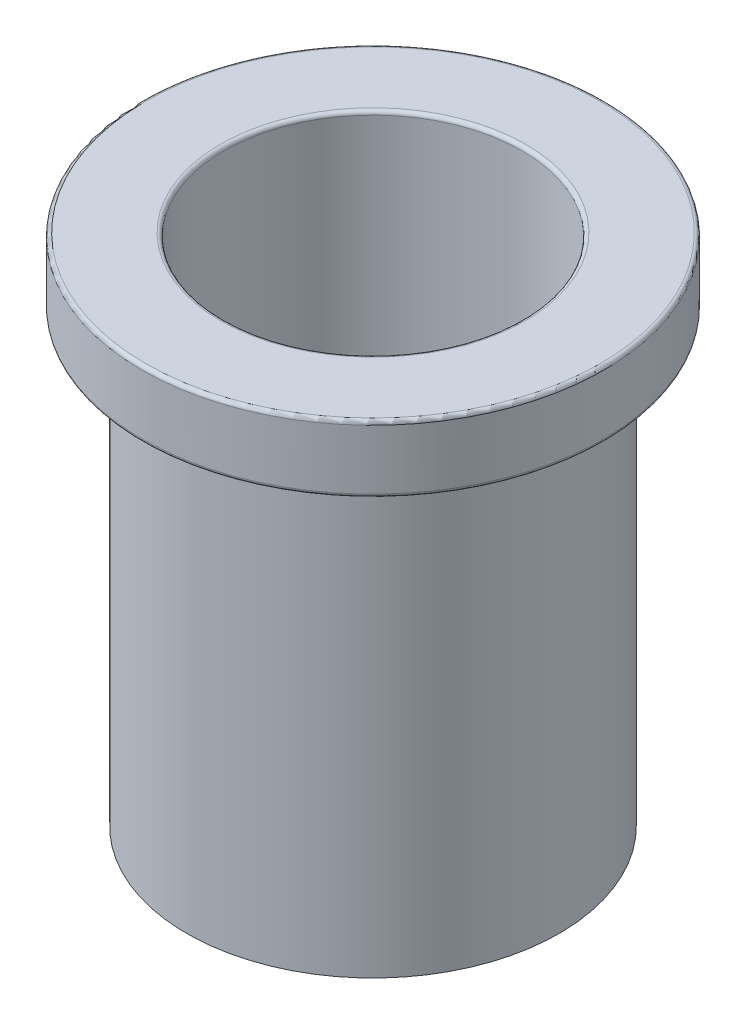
from build123d import *

# Parameters (mm, degrees)
FILLET1_R = 0.0635


with BuildPart() as part:
    # Sketch1 → Revolve1 (revolve)
    with BuildSketch(Plane.XY, mode=Mode.PRIVATE) as revolve1_sk:
        Polygon((2.54, 0), (2.54, 8.763), (3.937, 8.763), (3.937, 7.62), (3.175, 7.62), (3.175, 0), align=None)
    revolve(revolve1_sk.sketch.rotate(Axis((0, 0, 0), (0, 1, 0)), 90), axis=Axis((0, 0, 0), (0, 1, 0)))

    # Fillet1
    fillet1_edges = [part.edges().sort_by_distance(p)[0] for p in [
        (0, 8.763, 2.54),
        (0, 8.763, 3.937),
        (0, 7.62, 3.937),
    ]]
    fillet(fillet1_edges, radius=FILLET1_R)


solid = part.part
